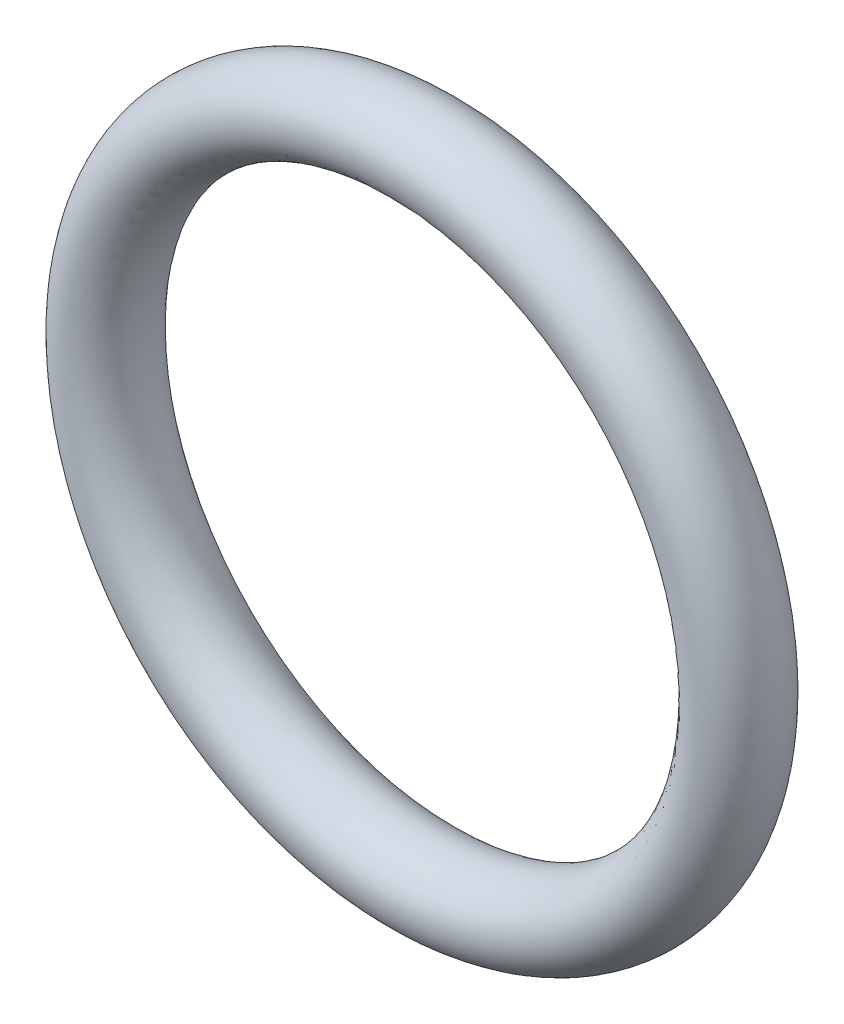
ISO-10303-21;
HEADER;
FILE_DESCRIPTION(('STEP AP214'),'2;1');
FILE_NAME('part.step','',(''),(''),'','','');
FILE_SCHEMA(('AUTOMOTIVE_DESIGN { 1 0 10303 214 1 1 1 1 }'));
ENDSEC;
DATA;
#1=APPLICATION_CONTEXT('core data for automotive mechanical design processes');
#2=APPLICATION_PROTOCOL_DEFINITION('international standard','automotive_design',2000,#1);
#3=PRODUCT_CONTEXT('',#1,'mechanical');
#4=PRODUCT('Part','Part','',(#3));
#5=PRODUCT_RELATED_PRODUCT_CATEGORY('part','',(#4));
#6=PRODUCT_DEFINITION_FORMATION('','',#4);
#7=PRODUCT_DEFINITION_CONTEXT('part definition',#1,'design');
#8=PRODUCT_DEFINITION('design','',#6,#7);
#9=PRODUCT_DEFINITION_SHAPE('','',#8);
#10=(LENGTH_UNIT() NAMED_UNIT(*) SI_UNIT(.MILLI.,.METRE.));
#11=(NAMED_UNIT(*) PLANE_ANGLE_UNIT() SI_UNIT($,.RADIAN.));
#12=(NAMED_UNIT(*) SI_UNIT($,.STERADIAN.) SOLID_ANGLE_UNIT());
#13=UNCERTAINTY_MEASURE_WITH_UNIT(LENGTH_MEASURE(1.E-05),#10,'distance_accuracy_value','');
#14=(GEOMETRIC_REPRESENTATION_CONTEXT(3) GLOBAL_UNCERTAINTY_ASSIGNED_CONTEXT((#13)) GLOBAL_UNIT_ASSIGNED_CONTEXT((#10,
#11,#12)) REPRESENTATION_CONTEXT('',''));
#15=CARTESIAN_POINT('',(0.,0.,0.));
#16=DIRECTION('',(0.,0.,1.));
#17=DIRECTION('',(1.,0.,0.));
#18=AXIS2_PLACEMENT_3D('',#15,#16,#17);
#19=CARTESIAN_POINT('',(0.,11.45,-1.6));
#20=DIRECTION('',(1.,0.,0.));
#21=DIRECTION('',(0.,0.,-1.));
#22=AXIS2_PLACEMENT_3D('',#19,#20,#21);
#23=ELLIPSE('',#22,1.6,1.45);
#24=CARTESIAN_POINT('',(0.,0.,0.));
#25=DIRECTION('',(0.,0.,1.));
#26=AXIS1_PLACEMENT('',#24,#25);
#27=SURFACE_OF_REVOLUTION('',#23,#26);
#28=ADVANCED_FACE('F28',(),#27,.T.);
#29=CLOSED_SHELL('',(#28));
#30=MANIFOLD_SOLID_BREP('B2',#29);
#31=ADVANCED_BREP_SHAPE_REPRESENTATION('',(#18,#30),#14);
#32=SHAPE_DEFINITION_REPRESENTATION(#9,#31);
ENDSEC;
END-ISO-10303-21;
